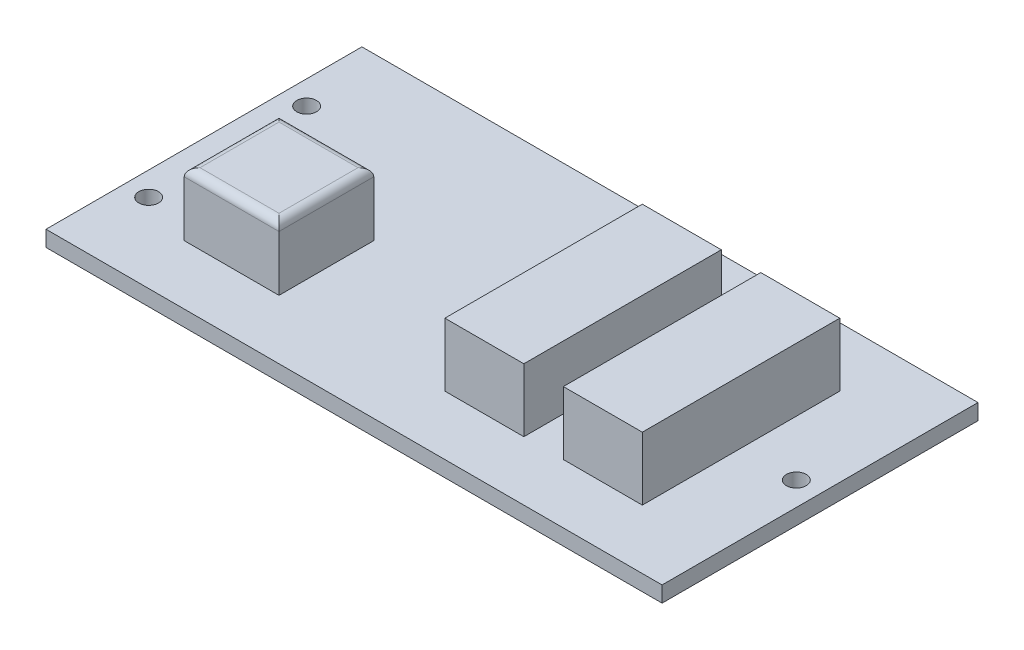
from build123d import *

# Parameters (mm, degrees)
SKETCH1_W          = 78
SKETCH1_H          = 40
EXTRUDE1_DEPTH     = 2
SKETCH2_W          = 10
SKETCH2_H          = 25
SKETCH2_W_2        = 12
SKETCH2_H_2        = 12
EXTRUDE2_DEPTH     = 8
SKETCH3_R          = 1.25
CUT_EXTRUDE2_DEPTH = 45.55333882
FILLET1_R          = 1


with BuildPart() as part:
    # Sketch1 → Extrude1 (new body)
    with BuildSketch(Plane(origin=(0, 0, 0), x_dir=(1, 0, 0), z_dir=(0, 1, 0))):
        Rectangle(SKETCH1_W, SKETCH1_H)
    extrude(amount=EXTRUDE1_DEPTH)

    # Sketch2 → Extrude2 (add)
    with BuildSketch(Plane(origin=(0, 2, 0), x_dir=(-1, 0, 0), z_dir=(0, 1, 0))):
        with Locations((-24, 0)):
            Rectangle(SKETCH2_W, SKETCH2_H)
        with Locations((-9, 0)):
            Rectangle(SKETCH2_W, SKETCH2_H)
        with Locations((23, 6.5)):
            Rectangle(SKETCH2_W_2, SKETCH2_H_2)
    extrude(amount=EXTRUDE2_DEPTH)

    # Sketch3 → Cut-Extrude2 (cut, through all)
    with BuildSketch(Plane(origin=(0, 2, 0), x_dir=(-1, 0, 0), z_dir=(0, 1, 0))):
        with Locations(Location((-36, 0, 0), (0, 0, 90))):
            Circle(SKETCH3_R)
        with Locations(Location((36, 10, 0), (0, 0, 90))):
            Circle(SKETCH3_R)
        with Locations(Location((36, -10, 0), (0, 0, 90))):
            Circle(SKETCH3_R)
    extrude(amount=-CUT_EXTRUDE2_DEPTH, mode=Mode.SUBTRACT)

    # Fillet1
    fillet1_edges = [part.edges().sort_by_distance(p)[0] for p in [
        (-17, 10, 6.5),
        (-23, 10, 0.5),
        (-29, 10, 6.5),
        (-23, 10, 12.5),
    ]]
    fillet(fillet1_edges, radius=FILLET1_R)


solid = part.part
